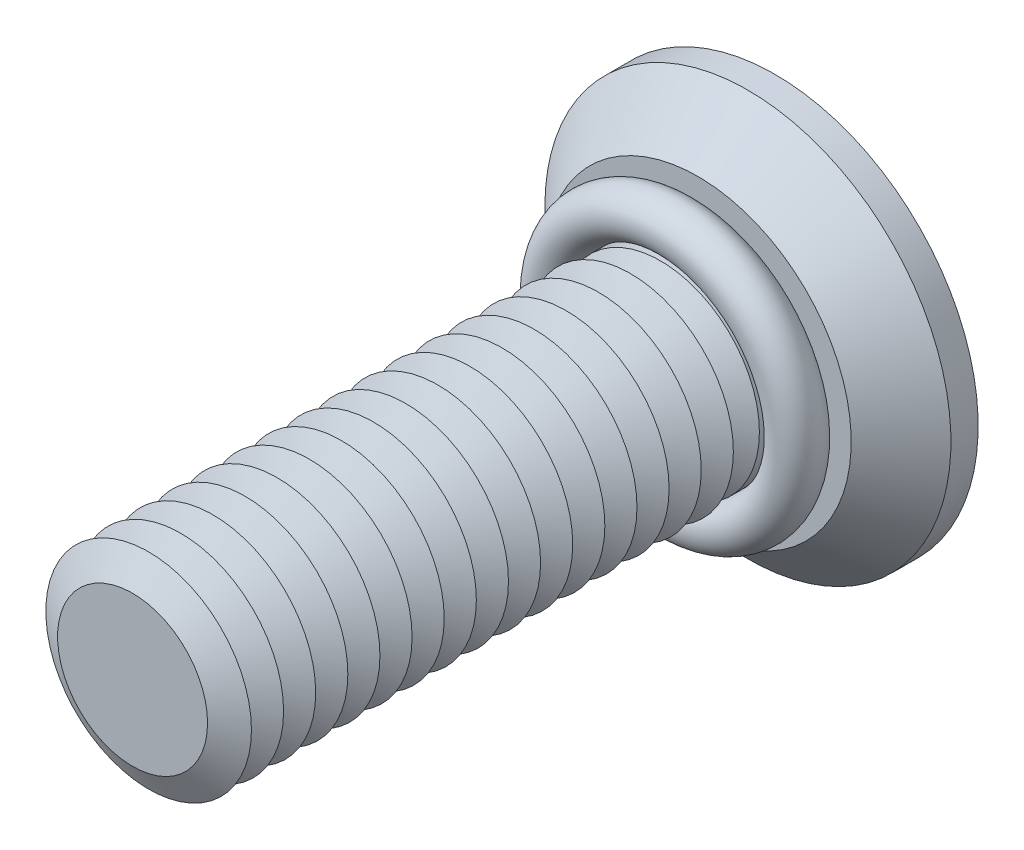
ISO-10303-21;
HEADER;
FILE_DESCRIPTION(('STEP AP214'),'2;1');
FILE_NAME('part.step','',(''),(''),'','','');
FILE_SCHEMA(('AUTOMOTIVE_DESIGN { 1 0 10303 214 1 1 1 1 }'));
ENDSEC;
DATA;
#1=APPLICATION_CONTEXT('core data for automotive mechanical design processes');
#2=APPLICATION_PROTOCOL_DEFINITION('international standard','automotive_design',2000,#1);
#3=PRODUCT_CONTEXT('',#1,'mechanical');
#4=PRODUCT('Part','Part','',(#3));
#5=PRODUCT_RELATED_PRODUCT_CATEGORY('part','',(#4));
#6=PRODUCT_DEFINITION_FORMATION('','',#4);
#7=PRODUCT_DEFINITION_CONTEXT('part definition',#1,'design');
#8=PRODUCT_DEFINITION('design','',#6,#7);
#9=PRODUCT_DEFINITION_SHAPE('','',#8);
#10=(LENGTH_UNIT() NAMED_UNIT(*) SI_UNIT(.MILLI.,.METRE.));
#11=(NAMED_UNIT(*) PLANE_ANGLE_UNIT() SI_UNIT($,.RADIAN.));
#12=(NAMED_UNIT(*) SI_UNIT($,.STERADIAN.) SOLID_ANGLE_UNIT());
#13=UNCERTAINTY_MEASURE_WITH_UNIT(LENGTH_MEASURE(1.E-05),#10,'distance_accuracy_value','');
#14=(GEOMETRIC_REPRESENTATION_CONTEXT(3) GLOBAL_UNCERTAINTY_ASSIGNED_CONTEXT((#13)) GLOBAL_UNIT_ASSIGNED_CONTEXT((#10,
#11,#12)) REPRESENTATION_CONTEXT('',''));
#15=CARTESIAN_POINT('',(0.,0.,0.));
#16=DIRECTION('',(0.,0.,1.));
#17=DIRECTION('',(1.,0.,0.));
#18=AXIS2_PLACEMENT_3D('',#15,#16,#17);
#19=CARTESIAN_POINT('',(0.,0.,3.9));
#20=DIRECTION('',(0.,0.,1.));
#21=DIRECTION('',(1.,0.,0.));
#22=AXIS2_PLACEMENT_3D('',#19,#20,#21);
#23=TOROIDAL_SURFACE('',#22,4.75,0.9);
#24=CARTESIAN_POINT('',(0.,4.75,3.9));
#25=DIRECTION('',(1.,0.,0.));
#26=DIRECTION('',(0.,0.,-1.));
#27=AXIS2_PLACEMENT_3D('',#24,#25,#26);
#28=CIRCLE('',#27,0.9);
#29=CARTESIAN_POINT('',(0.,5.65,3.9));
#30=VERTEX_POINT('',#29);
#31=EDGE_CURVE('P0_E10',#30,#30,#28,.T.);
#32=CARTESIAN_POINT('',(0.,0.,3.9));
#33=DIRECTION('',(0.,0.,1.));
#34=DIRECTION('',(1.,0.,0.));
#35=AXIS2_PLACEMENT_3D('',#32,#33,#34);
#36=CIRCLE('',#35,5.65);
#37=EDGE_CURVE('',#30,#30,#36,.T.);
#38=ORIENTED_EDGE('',*,*,#31,.F.);
#39=ORIENTED_EDGE('',*,*,#31,.T.);
#40=ORIENTED_EDGE('',*,*,#37,.T.);
#41=ORIENTED_EDGE('',*,*,#37,.F.);
#42=EDGE_LOOP('',(#38,#40,#39,#41));
#43=FACE_BOUND('',#42,.T.);
#44=ADVANCED_FACE('P0_F14',(#43),#23,.T.);
#45=CLOSED_SHELL('',(#44));
#46=MANIFOLD_SOLID_BREP('P0_B1',#45);
#47=CARTESIAN_POINT('',(0.,0.,18.75));
#48=DIRECTION('',(0.,0.,-1.));
#49=DIRECTION('',(-1.,0.,0.));
#50=AXIS2_PLACEMENT_3D('',#47,#48,#49);
#51=CONICAL_SURFACE('',#50,2.91746824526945,1.0471975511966);
#52=CARTESIAN_POINT('',(0.,0.,18.125));
#53=DIRECTION('',(0.,0.,1.));
#54=DIRECTION('',(1.,0.,0.));
#55=AXIS2_PLACEMENT_3D('',#52,#53,#54);
#56=CIRCLE('',#55,4.);
#57=CARTESIAN_POINT('',(4.,0.,18.125));
#58=VERTEX_POINT('',#57);
#59=EDGE_CURVE('P1_E324',#58,#58,#56,.T.);
#60=ORIENTED_EDGE('',*,*,#59,.T.);
#61=EDGE_LOOP('',(#60));
#62=FACE_BOUND('',#61,.T.);
#63=CARTESIAN_POINT('',(0.,0.,18.75));
#64=DIRECTION('',(0.,0.,1.));
#65=DIRECTION('',(1.,0.,0.));
#66=AXIS2_PLACEMENT_3D('',#63,#64,#65);
#67=CIRCLE('',#66,2.91746824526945);
#68=CARTESIAN_POINT('',(2.91746824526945,0.,18.75));
#69=VERTEX_POINT('',#68);
#70=EDGE_CURVE('P1_E321',#69,#69,#67,.T.);
#71=ORIENTED_EDGE('',*,*,#70,.F.);
#72=EDGE_LOOP('',(#71));
#73=FACE_BOUND('',#72,.T.);
#74=ADVANCED_FACE('P1_F15',(#62,#73),#51,.T.);
#75=CARTESIAN_POINT('',(0.,0.,19.375));
#76=DIRECTION('',(0.,0.,1.));
#77=DIRECTION('',(1.,0.,0.));
#78=AXIS2_PLACEMENT_3D('',#75,#76,#77);
#79=CONICAL_SURFACE('',#78,4.,1.0471975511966);
#80=ORIENTED_EDGE('',*,*,#70,.T.);
#81=EDGE_LOOP('',(#80));
#82=FACE_BOUND('',#81,.T.);
#83=CARTESIAN_POINT('',(0.,0.,19.375));
#84=DIRECTION('',(0.,0.,1.));
#85=DIRECTION('',(1.,0.,0.));
#86=AXIS2_PLACEMENT_3D('',#83,#84,#85);
#87=CIRCLE('',#86,4.);
#88=CARTESIAN_POINT('',(4.,0.,19.375));
#89=VERTEX_POINT('',#88);
#90=EDGE_CURVE('P1_E318',#89,#89,#87,.T.);
#91=ORIENTED_EDGE('',*,*,#90,.F.);
#92=EDGE_LOOP('',(#91));
#93=FACE_BOUND('',#92,.T.);
#94=ADVANCED_FACE('P1_F245',(#82,#93),#79,.T.);
#95=CARTESIAN_POINT('',(0.,0.,25.));
#96=DIRECTION('',(0.,0.,1.));
#97=DIRECTION('',(1.,0.,0.));
#98=AXIS2_PLACEMENT_3D('',#95,#96,#97);
#99=PLANE('',#98);
#100=CARTESIAN_POINT('',(0.,0.,25.));
#101=DIRECTION('',(0.,0.,1.));
#102=DIRECTION('',(1.,0.,0.));
#103=AXIS2_PLACEMENT_3D('',#100,#101,#102);
#104=CIRCLE('',#103,2.91746824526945);
#105=CARTESIAN_POINT('',(2.91746824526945,0.,25.));
#106=VERTEX_POINT('',#105);
#107=EDGE_CURVE('P1_E131',#106,#106,#104,.T.);
#108=ORIENTED_EDGE('',*,*,#107,.T.);
#109=EDGE_LOOP('',(#108));
#110=FACE_BOUND('',#109,.T.);
#111=ADVANCED_FACE('P1_F251',(#110),#99,.T.);
#112=CARTESIAN_POINT('',(0.,0.,25.));
#113=DIRECTION('',(0.,0.,-1.));
#114=DIRECTION('',(-1.,0.,0.));
#115=AXIS2_PLACEMENT_3D('',#112,#113,#114);
#116=CONICAL_SURFACE('',#115,2.91746824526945,1.0471975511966);
#117=CARTESIAN_POINT('',(0.,0.,24.375));
#118=DIRECTION('',(0.,0.,1.));
#119=DIRECTION('',(1.,0.,0.));
#120=AXIS2_PLACEMENT_3D('',#117,#118,#119);
#121=CIRCLE('',#120,4.);
#122=CARTESIAN_POINT('',(4.,0.,24.375));
#123=VERTEX_POINT('',#122);
#124=EDGE_CURVE('P1_E133',#123,#123,#121,.T.);
#125=ORIENTED_EDGE('',*,*,#124,.T.);
#126=EDGE_LOOP('',(#125));
#127=FACE_BOUND('',#126,.T.);
#128=ORIENTED_EDGE('',*,*,#107,.F.);
#129=EDGE_LOOP('',(#128));
#130=FACE_BOUND('',#129,.T.);
#131=ADVANCED_FACE('P1_F196',(#127,#130),#116,.T.);
#132=CARTESIAN_POINT('',(0.,0.,24.375));
#133=DIRECTION('',(0.,0.,1.));
#134=DIRECTION('',(1.,0.,0.));
#135=AXIS2_PLACEMENT_3D('',#132,#133,#134);
#136=CONICAL_SURFACE('',#135,4.,1.0471975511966);
#137=CARTESIAN_POINT('',(0.,0.,23.75));
#138=DIRECTION('',(0.,0.,1.));
#139=DIRECTION('',(1.,0.,0.));
#140=AXIS2_PLACEMENT_3D('',#137,#138,#139);
#141=CIRCLE('',#140,2.91746824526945);
#142=CARTESIAN_POINT('',(2.91746824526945,0.,23.75));
#143=VERTEX_POINT('',#142);
#144=EDGE_CURVE('P1_E297',#143,#143,#141,.T.);
#145=ORIENTED_EDGE('',*,*,#144,.T.);
#146=EDGE_LOOP('',(#145));
#147=FACE_BOUND('',#146,.T.);
#148=ORIENTED_EDGE('',*,*,#124,.F.);
#149=EDGE_LOOP('',(#148));
#150=FACE_BOUND('',#149,.T.);
#151=ADVANCED_FACE('P1_F284',(#147,#150),#136,.T.);
#152=CARTESIAN_POINT('',(0.,0.,23.75));
#153=DIRECTION('',(0.,0.,-1.));
#154=DIRECTION('',(-1.,0.,0.));
#155=AXIS2_PLACEMENT_3D('',#152,#153,#154);
#156=CONICAL_SURFACE('',#155,2.91746824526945,1.0471975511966);
#157=CARTESIAN_POINT('',(0.,0.,23.125));
#158=DIRECTION('',(0.,0.,1.));
#159=DIRECTION('',(1.,0.,0.));
#160=AXIS2_PLACEMENT_3D('',#157,#158,#159);
#161=CIRCLE('',#160,4.);
#162=CARTESIAN_POINT('',(4.,0.,23.125));
#163=VERTEX_POINT('',#162);
#164=EDGE_CURVE('P1_E294',#163,#163,#161,.T.);
#165=ORIENTED_EDGE('',*,*,#164,.T.);
#166=EDGE_LOOP('',(#165));
#167=FACE_BOUND('',#166,.T.);
#168=ORIENTED_EDGE('',*,*,#144,.F.);
#169=EDGE_LOOP('',(#168));
#170=FACE_BOUND('',#169,.T.);
#171=ADVANCED_FACE('P1_F279',(#167,#170),#156,.T.);
#172=CARTESIAN_POINT('',(0.,0.,23.125));
#173=DIRECTION('',(0.,0.,1.));
#174=DIRECTION('',(1.,0.,0.));
#175=AXIS2_PLACEMENT_3D('',#172,#173,#174);
#176=CONICAL_SURFACE('',#175,4.,1.0471975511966);
#177=CARTESIAN_POINT('',(0.,0.,22.5));
#178=DIRECTION('',(0.,0.,1.));
#179=DIRECTION('',(1.,0.,0.));
#180=AXIS2_PLACEMENT_3D('',#177,#178,#179);
#181=CIRCLE('',#180,2.91746824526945);
#182=CARTESIAN_POINT('',(2.91746824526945,0.,22.5));
#183=VERTEX_POINT('',#182);
#184=EDGE_CURVE('P1_E301',#183,#183,#181,.T.);
#185=ORIENTED_EDGE('',*,*,#184,.T.);
#186=EDGE_LOOP('',(#185));
#187=FACE_BOUND('',#186,.T.);
#188=ORIENTED_EDGE('',*,*,#164,.F.);
#189=EDGE_LOOP('',(#188));
#190=FACE_BOUND('',#189,.T.);
#191=ADVANCED_FACE('P1_F276',(#187,#190),#176,.T.);
#192=CARTESIAN_POINT('',(0.,0.,22.5));
#193=DIRECTION('',(0.,0.,-1.));
#194=DIRECTION('',(-1.,0.,0.));
#195=AXIS2_PLACEMENT_3D('',#192,#193,#194);
#196=CONICAL_SURFACE('',#195,2.91746824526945,1.0471975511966);
#197=CARTESIAN_POINT('',(0.,0.,21.875));
#198=DIRECTION('',(0.,0.,1.));
#199=DIRECTION('',(1.,0.,0.));
#200=AXIS2_PLACEMENT_3D('',#197,#198,#199);
#201=CIRCLE('',#200,4.);
#202=CARTESIAN_POINT('',(4.,0.,21.875));
#203=VERTEX_POINT('',#202);
#204=EDGE_CURVE('P1_E306',#203,#203,#201,.T.);
#205=ORIENTED_EDGE('',*,*,#204,.T.);
#206=EDGE_LOOP('',(#205));
#207=FACE_BOUND('',#206,.T.);
#208=ORIENTED_EDGE('',*,*,#184,.F.);
#209=EDGE_LOOP('',(#208));
#210=FACE_BOUND('',#209,.T.);
#211=ADVANCED_FACE('P1_F271',(#207,#210),#196,.T.);
#212=CARTESIAN_POINT('',(0.,0.,21.875));
#213=DIRECTION('',(0.,0.,1.));
#214=DIRECTION('',(1.,0.,0.));
#215=AXIS2_PLACEMENT_3D('',#212,#213,#214);
#216=CONICAL_SURFACE('',#215,4.,1.0471975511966);
#217=CARTESIAN_POINT('',(0.,0.,21.25));
#218=DIRECTION('',(0.,0.,1.));
#219=DIRECTION('',(1.,0.,0.));
#220=AXIS2_PLACEMENT_3D('',#217,#218,#219);
#221=CIRCLE('',#220,2.91746824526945);
#222=CARTESIAN_POINT('',(2.91746824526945,0.,21.25));
#223=VERTEX_POINT('',#222);
#224=EDGE_CURVE('P1_E309',#223,#223,#221,.T.);
#225=ORIENTED_EDGE('',*,*,#224,.T.);
#226=EDGE_LOOP('',(#225));
#227=FACE_BOUND('',#226,.T.);
#228=ORIENTED_EDGE('',*,*,#204,.F.);
#229=EDGE_LOOP('',(#228));
#230=FACE_BOUND('',#229,.T.);
#231=ADVANCED_FACE('P1_F268',(#227,#230),#216,.T.);
#232=CARTESIAN_POINT('',(0.,0.,21.25));
#233=DIRECTION('',(0.,0.,-1.));
#234=DIRECTION('',(-1.,0.,0.));
#235=AXIS2_PLACEMENT_3D('',#232,#233,#234);
#236=CONICAL_SURFACE('',#235,2.91746824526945,1.0471975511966);
#237=CARTESIAN_POINT('',(0.,0.,20.625));
#238=DIRECTION('',(0.,0.,1.));
#239=DIRECTION('',(1.,0.,0.));
#240=AXIS2_PLACEMENT_3D('',#237,#238,#239);
#241=CIRCLE('',#240,4.);
#242=CARTESIAN_POINT('',(4.,0.,20.625));
#243=VERTEX_POINT('',#242);
#244=EDGE_CURVE('P1_E312',#243,#243,#241,.T.);
#245=ORIENTED_EDGE('',*,*,#244,.T.);
#246=EDGE_LOOP('',(#245));
#247=FACE_BOUND('',#246,.T.);
#248=ORIENTED_EDGE('',*,*,#224,.F.);
#249=EDGE_LOOP('',(#248));
#250=FACE_BOUND('',#249,.T.);
#251=ADVANCED_FACE('P1_F262',(#247,#250),#236,.T.);
#252=CARTESIAN_POINT('',(0.,0.,20.625));
#253=DIRECTION('',(0.,0.,1.));
#254=DIRECTION('',(1.,0.,0.));
#255=AXIS2_PLACEMENT_3D('',#252,#253,#254);
#256=CONICAL_SURFACE('',#255,4.,1.0471975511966);
#257=CARTESIAN_POINT('',(0.,0.,20.));
#258=DIRECTION('',(0.,0.,1.));
#259=DIRECTION('',(1.,0.,0.));
#260=AXIS2_PLACEMENT_3D('',#257,#258,#259);
#261=CIRCLE('',#260,2.91746824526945);
#262=CARTESIAN_POINT('',(2.91746824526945,0.,20.));
#263=VERTEX_POINT('',#262);
#264=EDGE_CURVE('P1_E315',#263,#263,#261,.T.);
#265=ORIENTED_EDGE('',*,*,#264,.T.);
#266=EDGE_LOOP('',(#265));
#267=FACE_BOUND('',#266,.T.);
#268=ORIENTED_EDGE('',*,*,#244,.F.);
#269=EDGE_LOOP('',(#268));
#270=FACE_BOUND('',#269,.T.);
#271=ADVANCED_FACE('P1_F258',(#267,#270),#256,.T.);
#272=CARTESIAN_POINT('',(0.,0.,20.));
#273=DIRECTION('',(0.,0.,-1.));
#274=DIRECTION('',(-1.,0.,0.));
#275=AXIS2_PLACEMENT_3D('',#272,#273,#274);
#276=CONICAL_SURFACE('',#275,2.91746824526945,1.0471975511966);
#277=ORIENTED_EDGE('',*,*,#90,.T.);
#278=EDGE_LOOP('',(#277));
#279=FACE_BOUND('',#278,.T.);
#280=ORIENTED_EDGE('',*,*,#264,.F.);
#281=EDGE_LOOP('',(#280));
#282=FACE_BOUND('',#281,.T.);
#283=ADVANCED_FACE('P1_F261',(#279,#282),#276,.T.);
#284=CARTESIAN_POINT('',(0.,0.,17.5));
#285=DIRECTION('',(0.,0.,-1.));
#286=DIRECTION('',(-1.,0.,0.));
#287=AXIS2_PLACEMENT_3D('',#284,#285,#286);
#288=CONICAL_SURFACE('',#287,2.91746824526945,1.0471975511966);
#289=CARTESIAN_POINT('',(0.,0.,16.875));
#290=DIRECTION('',(0.,0.,1.));
#291=DIRECTION('',(1.,0.,0.));
#292=AXIS2_PLACEMENT_3D('',#289,#290,#291);
#293=CIRCLE('',#292,4.);
#294=CARTESIAN_POINT('',(4.,0.,16.875));
#295=VERTEX_POINT('',#294);
#296=EDGE_CURVE('P1_E329',#295,#295,#293,.T.);
#297=ORIENTED_EDGE('',*,*,#296,.T.);
#298=EDGE_LOOP('',(#297));
#299=FACE_BOUND('',#298,.T.);
#300=CARTESIAN_POINT('',(0.,0.,17.5));
#301=DIRECTION('',(0.,0.,1.));
#302=DIRECTION('',(1.,0.,0.));
#303=AXIS2_PLACEMENT_3D('',#300,#301,#302);
#304=CIRCLE('',#303,2.91746824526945);
#305=CARTESIAN_POINT('',(2.91746824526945,0.,17.5));
#306=VERTEX_POINT('',#305);
#307=EDGE_CURVE('P1_E326',#306,#306,#304,.T.);
#308=ORIENTED_EDGE('',*,*,#307,.F.);
#309=EDGE_LOOP('',(#308));
#310=FACE_BOUND('',#309,.T.);
#311=ADVANCED_FACE('P1_F266',(#299,#310),#288,.T.);
#312=CARTESIAN_POINT('',(0.,0.,18.125));
#313=DIRECTION('',(0.,0.,1.));
#314=DIRECTION('',(1.,0.,0.));
#315=AXIS2_PLACEMENT_3D('',#312,#313,#314);
#316=CONICAL_SURFACE('',#315,4.,1.0471975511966);
#317=ORIENTED_EDGE('',*,*,#307,.T.);
#318=EDGE_LOOP('',(#317));
#319=FACE_BOUND('',#318,.T.);
#320=ORIENTED_EDGE('',*,*,#59,.F.);
#321=EDGE_LOOP('',(#320));
#322=FACE_BOUND('',#321,.T.);
#323=ADVANCED_FACE('P1_F491',(#319,#322),#316,.T.);
#324=CARTESIAN_POINT('',(0.,0.,16.25));
#325=DIRECTION('',(0.,0.,-1.));
#326=DIRECTION('',(-1.,0.,0.));
#327=AXIS2_PLACEMENT_3D('',#324,#325,#326);
#328=CONICAL_SURFACE('',#327,2.91746824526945,1.0471975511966);
#329=CARTESIAN_POINT('',(0.,0.,15.625));
#330=DIRECTION('',(0.,0.,1.));
#331=DIRECTION('',(1.,0.,0.));
#332=AXIS2_PLACEMENT_3D('',#329,#330,#331);
#333=CIRCLE('',#332,4.);
#334=CARTESIAN_POINT('',(4.,0.,15.625));
#335=VERTEX_POINT('',#334);
#336=EDGE_CURVE('P1_E335',#335,#335,#333,.T.);
#337=ORIENTED_EDGE('',*,*,#336,.T.);
#338=EDGE_LOOP('',(#337));
#339=FACE_BOUND('',#338,.T.);
#340=CARTESIAN_POINT('',(0.,0.,16.25));
#341=DIRECTION('',(0.,0.,1.));
#342=DIRECTION('',(1.,0.,0.));
#343=AXIS2_PLACEMENT_3D('',#340,#341,#342);
#344=CIRCLE('',#343,2.91746824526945);
#345=CARTESIAN_POINT('',(2.91746824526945,0.,16.25));
#346=VERTEX_POINT('',#345);
#347=EDGE_CURVE('P1_E332',#346,#346,#344,.T.);
#348=ORIENTED_EDGE('',*,*,#347,.F.);
#349=EDGE_LOOP('',(#348));
#350=FACE_BOUND('',#349,.T.);
#351=ADVANCED_FACE('P1_F501',(#339,#350),#328,.T.);
#352=CARTESIAN_POINT('',(0.,0.,16.875));
#353=DIRECTION('',(0.,0.,1.));
#354=DIRECTION('',(1.,0.,0.));
#355=AXIS2_PLACEMENT_3D('',#352,#353,#354);
#356=CONICAL_SURFACE('',#355,4.,1.0471975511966);
#357=ORIENTED_EDGE('',*,*,#347,.T.);
#358=EDGE_LOOP('',(#357));
#359=FACE_BOUND('',#358,.T.);
#360=ORIENTED_EDGE('',*,*,#296,.F.);
#361=EDGE_LOOP('',(#360));
#362=FACE_BOUND('',#361,.T.);
#363=ADVANCED_FACE('P1_F511',(#359,#362),#356,.T.);
#364=CARTESIAN_POINT('',(0.,0.,15.));
#365=DIRECTION('',(0.,0.,-1.));
#366=DIRECTION('',(-1.,0.,0.));
#367=AXIS2_PLACEMENT_3D('',#364,#365,#366);
#368=CONICAL_SURFACE('',#367,2.91746824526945,1.0471975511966);
#369=CARTESIAN_POINT('',(0.,0.,14.375));
#370=DIRECTION('',(0.,0.,1.));
#371=DIRECTION('',(1.,0.,0.));
#372=AXIS2_PLACEMENT_3D('',#369,#370,#371);
#373=CIRCLE('',#372,4.);
#374=CARTESIAN_POINT('',(4.,0.,14.375));
#375=VERTEX_POINT('',#374);
#376=EDGE_CURVE('P1_E341',#375,#375,#373,.T.);
#377=ORIENTED_EDGE('',*,*,#376,.T.);
#378=EDGE_LOOP('',(#377));
#379=FACE_BOUND('',#378,.T.);
#380=CARTESIAN_POINT('',(0.,0.,15.));
#381=DIRECTION('',(0.,0.,1.));
#382=DIRECTION('',(1.,0.,0.));
#383=AXIS2_PLACEMENT_3D('',#380,#381,#382);
#384=CIRCLE('',#383,2.91746824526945);
#385=CARTESIAN_POINT('',(2.91746824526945,0.,15.));
#386=VERTEX_POINT('',#385);
#387=EDGE_CURVE('P1_E338',#386,#386,#384,.T.);
#388=ORIENTED_EDGE('',*,*,#387,.F.);
#389=EDGE_LOOP('',(#388));
#390=FACE_BOUND('',#389,.T.);
#391=ADVANCED_FACE('P1_F521',(#379,#390),#368,.T.);
#392=CARTESIAN_POINT('',(0.,0.,15.625));
#393=DIRECTION('',(0.,0.,1.));
#394=DIRECTION('',(1.,0.,0.));
#395=AXIS2_PLACEMENT_3D('',#392,#393,#394);
#396=CONICAL_SURFACE('',#395,4.,1.0471975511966);
#397=ORIENTED_EDGE('',*,*,#387,.T.);
#398=EDGE_LOOP('',(#397));
#399=FACE_BOUND('',#398,.T.);
#400=ORIENTED_EDGE('',*,*,#336,.F.);
#401=EDGE_LOOP('',(#400));
#402=FACE_BOUND('',#401,.T.);
#403=ADVANCED_FACE('P1_F531',(#399,#402),#396,.T.);
#404=CARTESIAN_POINT('',(0.,0.,13.75));
#405=DIRECTION('',(0.,0.,-1.));
#406=DIRECTION('',(-1.,0.,0.));
#407=AXIS2_PLACEMENT_3D('',#404,#405,#406);
#408=CONICAL_SURFACE('',#407,2.91746824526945,1.0471975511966);
#409=CARTESIAN_POINT('',(0.,0.,13.125));
#410=DIRECTION('',(0.,0.,1.));
#411=DIRECTION('',(1.,0.,0.));
#412=AXIS2_PLACEMENT_3D('',#409,#410,#411);
#413=CIRCLE('',#412,4.);
#414=CARTESIAN_POINT('',(4.,0.,13.125));
#415=VERTEX_POINT('',#414);
#416=EDGE_CURVE('P1_E347',#415,#415,#413,.T.);
#417=ORIENTED_EDGE('',*,*,#416,.T.);
#418=EDGE_LOOP('',(#417));
#419=FACE_BOUND('',#418,.T.);
#420=CARTESIAN_POINT('',(0.,0.,13.75));
#421=DIRECTION('',(0.,0.,1.));
#422=DIRECTION('',(1.,0.,0.));
#423=AXIS2_PLACEMENT_3D('',#420,#421,#422);
#424=CIRCLE('',#423,2.91746824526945);
#425=CARTESIAN_POINT('',(2.91746824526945,0.,13.75));
#426=VERTEX_POINT('',#425);
#427=EDGE_CURVE('P1_E344',#426,#426,#424,.T.);
#428=ORIENTED_EDGE('',*,*,#427,.F.);
#429=EDGE_LOOP('',(#428));
#430=FACE_BOUND('',#429,.T.);
#431=ADVANCED_FACE('P1_F541',(#419,#430),#408,.T.);
#432=CARTESIAN_POINT('',(0.,0.,14.375));
#433=DIRECTION('',(0.,0.,1.));
#434=DIRECTION('',(1.,0.,0.));
#435=AXIS2_PLACEMENT_3D('',#432,#433,#434);
#436=CONICAL_SURFACE('',#435,4.,1.0471975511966);
#437=ORIENTED_EDGE('',*,*,#427,.T.);
#438=EDGE_LOOP('',(#437));
#439=FACE_BOUND('',#438,.T.);
#440=ORIENTED_EDGE('',*,*,#376,.F.);
#441=EDGE_LOOP('',(#440));
#442=FACE_BOUND('',#441,.T.);
#443=ADVANCED_FACE('P1_F551',(#439,#442),#436,.T.);
#444=CARTESIAN_POINT('',(0.,0.,12.5));
#445=DIRECTION('',(0.,0.,-1.));
#446=DIRECTION('',(-1.,0.,0.));
#447=AXIS2_PLACEMENT_3D('',#444,#445,#446);
#448=CONICAL_SURFACE('',#447,2.91746824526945,1.0471975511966);
#449=CARTESIAN_POINT('',(0.,0.,11.875));
#450=DIRECTION('',(0.,0.,1.));
#451=DIRECTION('',(1.,0.,0.));
#452=AXIS2_PLACEMENT_3D('',#449,#450,#451);
#453=CIRCLE('',#452,4.);
#454=CARTESIAN_POINT('',(4.,0.,11.875));
#455=VERTEX_POINT('',#454);
#456=EDGE_CURVE('P1_E353',#455,#455,#453,.T.);
#457=ORIENTED_EDGE('',*,*,#456,.T.);
#458=EDGE_LOOP('',(#457));
#459=FACE_BOUND('',#458,.T.);
#460=CARTESIAN_POINT('',(0.,0.,12.5));
#461=DIRECTION('',(0.,0.,1.));
#462=DIRECTION('',(1.,0.,0.));
#463=AXIS2_PLACEMENT_3D('',#460,#461,#462);
#464=CIRCLE('',#463,2.91746824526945);
#465=CARTESIAN_POINT('',(2.91746824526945,0.,12.5));
#466=VERTEX_POINT('',#465);
#467=EDGE_CURVE('P1_E350',#466,#466,#464,.T.);
#468=ORIENTED_EDGE('',*,*,#467,.F.);
#469=EDGE_LOOP('',(#468));
#470=FACE_BOUND('',#469,.T.);
#471=ADVANCED_FACE('P1_F561',(#459,#470),#448,.T.);
#472=CARTESIAN_POINT('',(0.,0.,13.125));
#473=DIRECTION('',(0.,0.,1.));
#474=DIRECTION('',(1.,0.,0.));
#475=AXIS2_PLACEMENT_3D('',#472,#473,#474);
#476=CONICAL_SURFACE('',#475,4.,1.0471975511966);
#477=ORIENTED_EDGE('',*,*,#467,.T.);
#478=EDGE_LOOP('',(#477));
#479=FACE_BOUND('',#478,.T.);
#480=ORIENTED_EDGE('',*,*,#416,.F.);
#481=EDGE_LOOP('',(#480));
#482=FACE_BOUND('',#481,.T.);
#483=ADVANCED_FACE('P1_F571',(#479,#482),#476,.T.);
#484=CARTESIAN_POINT('',(0.,0.,11.25));
#485=DIRECTION('',(0.,0.,-1.));
#486=DIRECTION('',(-1.,0.,0.));
#487=AXIS2_PLACEMENT_3D('',#484,#485,#486);
#488=CONICAL_SURFACE('',#487,2.91746824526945,1.0471975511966);
#489=CARTESIAN_POINT('',(0.,0.,10.625));
#490=DIRECTION('',(0.,0.,1.));
#491=DIRECTION('',(1.,0.,0.));
#492=AXIS2_PLACEMENT_3D('',#489,#490,#491);
#493=CIRCLE('',#492,4.);
#494=CARTESIAN_POINT('',(4.,0.,10.625));
#495=VERTEX_POINT('',#494);
#496=EDGE_CURVE('P1_E359',#495,#495,#493,.T.);
#497=ORIENTED_EDGE('',*,*,#496,.T.);
#498=EDGE_LOOP('',(#497));
#499=FACE_BOUND('',#498,.T.);
#500=CARTESIAN_POINT('',(0.,0.,11.25));
#501=DIRECTION('',(0.,0.,1.));
#502=DIRECTION('',(1.,0.,0.));
#503=AXIS2_PLACEMENT_3D('',#500,#501,#502);
#504=CIRCLE('',#503,2.91746824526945);
#505=CARTESIAN_POINT('',(2.91746824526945,0.,11.25));
#506=VERTEX_POINT('',#505);
#507=EDGE_CURVE('P1_E356',#506,#506,#504,.T.);
#508=ORIENTED_EDGE('',*,*,#507,.F.);
#509=EDGE_LOOP('',(#508));
#510=FACE_BOUND('',#509,.T.);
#511=ADVANCED_FACE('P1_F581',(#499,#510),#488,.T.);
#512=CARTESIAN_POINT('',(0.,0.,11.875));
#513=DIRECTION('',(0.,0.,1.));
#514=DIRECTION('',(1.,0.,0.));
#515=AXIS2_PLACEMENT_3D('',#512,#513,#514);
#516=CONICAL_SURFACE('',#515,4.,1.0471975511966);
#517=ORIENTED_EDGE('',*,*,#507,.T.);
#518=EDGE_LOOP('',(#517));
#519=FACE_BOUND('',#518,.T.);
#520=ORIENTED_EDGE('',*,*,#456,.F.);
#521=EDGE_LOOP('',(#520));
#522=FACE_BOUND('',#521,.T.);
#523=ADVANCED_FACE('P1_F591',(#519,#522),#516,.T.);
#524=CARTESIAN_POINT('',(0.,0.,10.));
#525=DIRECTION('',(0.,0.,-1.));
#526=DIRECTION('',(-1.,0.,0.));
#527=AXIS2_PLACEMENT_3D('',#524,#525,#526);
#528=CONICAL_SURFACE('',#527,2.91746824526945,1.0471975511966);
#529=CARTESIAN_POINT('',(0.,0.,9.375));
#530=DIRECTION('',(0.,0.,1.));
#531=DIRECTION('',(1.,0.,0.));
#532=AXIS2_PLACEMENT_3D('',#529,#530,#531);
#533=CIRCLE('',#532,4.);
#534=CARTESIAN_POINT('',(4.,0.,9.375));
#535=VERTEX_POINT('',#534);
#536=EDGE_CURVE('P1_E365',#535,#535,#533,.T.);
#537=ORIENTED_EDGE('',*,*,#536,.T.);
#538=EDGE_LOOP('',(#537));
#539=FACE_BOUND('',#538,.T.);
#540=CARTESIAN_POINT('',(0.,0.,10.));
#541=DIRECTION('',(0.,0.,1.));
#542=DIRECTION('',(1.,0.,0.));
#543=AXIS2_PLACEMENT_3D('',#540,#541,#542);
#544=CIRCLE('',#543,2.91746824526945);
#545=CARTESIAN_POINT('',(2.91746824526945,0.,10.));
#546=VERTEX_POINT('',#545);
#547=EDGE_CURVE('P1_E362',#546,#546,#544,.T.);
#548=ORIENTED_EDGE('',*,*,#547,.F.);
#549=EDGE_LOOP('',(#548));
#550=FACE_BOUND('',#549,.T.);
#551=ADVANCED_FACE('P1_F601',(#539,#550),#528,.T.);
#552=CARTESIAN_POINT('',(0.,0.,10.625));
#553=DIRECTION('',(0.,0.,1.));
#554=DIRECTION('',(1.,0.,0.));
#555=AXIS2_PLACEMENT_3D('',#552,#553,#554);
#556=CONICAL_SURFACE('',#555,4.,1.0471975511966);
#557=ORIENTED_EDGE('',*,*,#547,.T.);
#558=EDGE_LOOP('',(#557));
#559=FACE_BOUND('',#558,.T.);
#560=ORIENTED_EDGE('',*,*,#496,.F.);
#561=EDGE_LOOP('',(#560));
#562=FACE_BOUND('',#561,.T.);
#563=ADVANCED_FACE('P1_F611',(#559,#562),#556,.T.);
#564=CARTESIAN_POINT('',(0.,0.,8.75));
#565=DIRECTION('',(0.,0.,-1.));
#566=DIRECTION('',(-1.,0.,0.));
#567=AXIS2_PLACEMENT_3D('',#564,#565,#566);
#568=CONICAL_SURFACE('',#567,2.91746824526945,1.0471975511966);
#569=CARTESIAN_POINT('',(0.,0.,8.125));
#570=DIRECTION('',(0.,0.,1.));
#571=DIRECTION('',(1.,0.,0.));
#572=AXIS2_PLACEMENT_3D('',#569,#570,#571);
#573=CIRCLE('',#572,4.);
#574=CARTESIAN_POINT('',(4.,0.,8.125));
#575=VERTEX_POINT('',#574);
#576=EDGE_CURVE('P1_E371',#575,#575,#573,.T.);
#577=ORIENTED_EDGE('',*,*,#576,.T.);
#578=EDGE_LOOP('',(#577));
#579=FACE_BOUND('',#578,.T.);
#580=CARTESIAN_POINT('',(0.,0.,8.75));
#581=DIRECTION('',(0.,0.,1.));
#582=DIRECTION('',(1.,0.,0.));
#583=AXIS2_PLACEMENT_3D('',#580,#581,#582);
#584=CIRCLE('',#583,2.91746824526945);
#585=CARTESIAN_POINT('',(2.91746824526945,0.,8.75));
#586=VERTEX_POINT('',#585);
#587=EDGE_CURVE('P1_E368',#586,#586,#584,.T.);
#588=ORIENTED_EDGE('',*,*,#587,.F.);
#589=EDGE_LOOP('',(#588));
#590=FACE_BOUND('',#589,.T.);
#591=ADVANCED_FACE('P1_F621',(#579,#590),#568,.T.);
#592=CARTESIAN_POINT('',(0.,0.,9.375));
#593=DIRECTION('',(0.,0.,1.));
#594=DIRECTION('',(1.,0.,0.));
#595=AXIS2_PLACEMENT_3D('',#592,#593,#594);
#596=CONICAL_SURFACE('',#595,4.,1.0471975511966);
#597=ORIENTED_EDGE('',*,*,#587,.T.);
#598=EDGE_LOOP('',(#597));
#599=FACE_BOUND('',#598,.T.);
#600=ORIENTED_EDGE('',*,*,#536,.F.);
#601=EDGE_LOOP('',(#600));
#602=FACE_BOUND('',#601,.T.);
#603=ADVANCED_FACE('P1_F631',(#599,#602),#596,.T.);
#604=CARTESIAN_POINT('',(0.,0.,7.5));
#605=DIRECTION('',(0.,0.,-1.));
#606=DIRECTION('',(-1.,0.,0.));
#607=AXIS2_PLACEMENT_3D('',#604,#605,#606);
#608=CONICAL_SURFACE('',#607,2.91746824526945,1.0471975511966);
#609=CARTESIAN_POINT('',(0.,0.,6.875));
#610=DIRECTION('',(0.,0.,1.));
#611=DIRECTION('',(1.,0.,0.));
#612=AXIS2_PLACEMENT_3D('',#609,#610,#611);
#613=CIRCLE('',#612,4.);
#614=CARTESIAN_POINT('',(4.,0.,6.875));
#615=VERTEX_POINT('',#614);
#616=EDGE_CURVE('P1_E377',#615,#615,#613,.T.);
#617=ORIENTED_EDGE('',*,*,#616,.T.);
#618=EDGE_LOOP('',(#617));
#619=FACE_BOUND('',#618,.T.);
#620=CARTESIAN_POINT('',(0.,0.,7.5));
#621=DIRECTION('',(0.,0.,1.));
#622=DIRECTION('',(1.,0.,0.));
#623=AXIS2_PLACEMENT_3D('',#620,#621,#622);
#624=CIRCLE('',#623,2.91746824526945);
#625=CARTESIAN_POINT('',(2.91746824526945,0.,7.5));
#626=VERTEX_POINT('',#625);
#627=EDGE_CURVE('P1_E374',#626,#626,#624,.T.);
#628=ORIENTED_EDGE('',*,*,#627,.F.);
#629=EDGE_LOOP('',(#628));
#630=FACE_BOUND('',#629,.T.);
#631=ADVANCED_FACE('P1_F641',(#619,#630),#608,.T.);
#632=CARTESIAN_POINT('',(0.,0.,8.125));
#633=DIRECTION('',(0.,0.,1.));
#634=DIRECTION('',(1.,0.,0.));
#635=AXIS2_PLACEMENT_3D('',#632,#633,#634);
#636=CONICAL_SURFACE('',#635,4.,1.0471975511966);
#637=ORIENTED_EDGE('',*,*,#627,.T.);
#638=EDGE_LOOP('',(#637));
#639=FACE_BOUND('',#638,.T.);
#640=ORIENTED_EDGE('',*,*,#576,.F.);
#641=EDGE_LOOP('',(#640));
#642=FACE_BOUND('',#641,.T.);
#643=ADVANCED_FACE('P1_F651',(#639,#642),#636,.T.);
#644=CARTESIAN_POINT('',(0.,0.,6.25));
#645=DIRECTION('',(0.,0.,-1.));
#646=DIRECTION('',(-1.,0.,0.));
#647=AXIS2_PLACEMENT_3D('',#644,#645,#646);
#648=CONICAL_SURFACE('',#647,2.91746824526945,1.0471975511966);
#649=CARTESIAN_POINT('',(0.,0.,5.625));
#650=DIRECTION('',(0.,0.,1.));
#651=DIRECTION('',(1.,0.,0.));
#652=AXIS2_PLACEMENT_3D('',#649,#650,#651);
#653=CIRCLE('',#652,4.);
#654=CARTESIAN_POINT('',(4.,0.,5.625));
#655=VERTEX_POINT('',#654);
#656=EDGE_CURVE('P1_E383',#655,#655,#653,.T.);
#657=ORIENTED_EDGE('',*,*,#656,.T.);
#658=EDGE_LOOP('',(#657));
#659=FACE_BOUND('',#658,.T.);
#660=CARTESIAN_POINT('',(0.,0.,6.25));
#661=DIRECTION('',(0.,0.,1.));
#662=DIRECTION('',(1.,0.,0.));
#663=AXIS2_PLACEMENT_3D('',#660,#661,#662);
#664=CIRCLE('',#663,2.91746824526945);
#665=CARTESIAN_POINT('',(2.91746824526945,0.,6.25));
#666=VERTEX_POINT('',#665);
#667=EDGE_CURVE('P1_E380',#666,#666,#664,.T.);
#668=ORIENTED_EDGE('',*,*,#667,.F.);
#669=EDGE_LOOP('',(#668));
#670=FACE_BOUND('',#669,.T.);
#671=ADVANCED_FACE('P1_F661',(#659,#670),#648,.T.);
#672=CARTESIAN_POINT('',(0.,0.,6.875));
#673=DIRECTION('',(0.,0.,1.));
#674=DIRECTION('',(1.,0.,0.));
#675=AXIS2_PLACEMENT_3D('',#672,#673,#674);
#676=CONICAL_SURFACE('',#675,4.,1.0471975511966);
#677=ORIENTED_EDGE('',*,*,#667,.T.);
#678=EDGE_LOOP('',(#677));
#679=FACE_BOUND('',#678,.T.);
#680=ORIENTED_EDGE('',*,*,#616,.F.);
#681=EDGE_LOOP('',(#680));
#682=FACE_BOUND('',#681,.T.);
#683=ADVANCED_FACE('P1_F396',(#679,#682),#676,.T.);
#684=CARTESIAN_POINT('',(0.,0.,5.));
#685=DIRECTION('',(0.,0.,-1.));
#686=DIRECTION('',(-1.,0.,0.));
#687=AXIS2_PLACEMENT_3D('',#684,#685,#686);
#688=CONICAL_SURFACE('',#687,2.91746824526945,1.0471975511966);
#689=CARTESIAN_POINT('',(0.,0.,5.));
#690=DIRECTION('',(0.,0.,1.));
#691=DIRECTION('',(1.,0.,0.));
#692=AXIS2_PLACEMENT_3D('',#689,#690,#691);
#693=CIRCLE('',#692,2.91746824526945);
#694=CARTESIAN_POINT('',(2.91746824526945,0.,5.));
#695=VERTEX_POINT('',#694);
#696=EDGE_CURVE('P1_E386',#695,#695,#693,.T.);
#697=ORIENTED_EDGE('',*,*,#696,.F.);
#698=EDGE_LOOP('',(#697));
#699=FACE_BOUND('',#698,.T.);
#700=CARTESIAN_POINT('',(0.,0.,4.46160254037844));
#701=DIRECTION('',(0.,0.,-1.));
#702=DIRECTION('',(-1.,0.,0.));
#703=AXIS2_PLACEMENT_3D('',#700,#701,#702);
#704=CIRCLE('',#703,3.85);
#705=CARTESIAN_POINT('',(-3.85,0.,4.46160254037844));
#706=VERTEX_POINT('',#705);
#707=EDGE_CURVE('P1_E19',#706,#706,#704,.F.);
#708=ORIENTED_EDGE('',*,*,#707,.T.);
#709=EDGE_LOOP('',(#708));
#710=FACE_BOUND('',#709,.T.);
#711=ADVANCED_FACE('P1_F393',(#699,#710),#688,.T.);
#712=CARTESIAN_POINT('',(0.,0.,5.625));
#713=DIRECTION('',(0.,0.,1.));
#714=DIRECTION('',(1.,0.,0.));
#715=AXIS2_PLACEMENT_3D('',#712,#713,#714);
#716=CONICAL_SURFACE('',#715,4.,1.0471975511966);
#717=ORIENTED_EDGE('',*,*,#696,.T.);
#718=EDGE_LOOP('',(#717));
#719=FACE_BOUND('',#718,.T.);
#720=ORIENTED_EDGE('',*,*,#656,.F.);
#721=EDGE_LOOP('',(#720));
#722=FACE_BOUND('',#721,.T.);
#723=ADVANCED_FACE('P1_F390',(#719,#722),#716,.T.);
#724=CARTESIAN_POINT('',(0.,0.,3.));
#725=DIRECTION('',(0.,0.,-1.));
#726=DIRECTION('',(-1.,0.,0.));
#727=AXIS2_PLACEMENT_3D('',#724,#725,#726);
#728=CONICAL_SURFACE('',#727,2.5,1.0471975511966);
#729=CARTESIAN_POINT('',(0.,0.,4.44337567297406));
#730=VERTEX_POINT('',#729);
#731=VERTEX_LOOP('',#730);
#732=FACE_BOUND('',#731,.T.);
#733=CARTESIAN_POINT('',(0.,0.,3.));
#734=DIRECTION('',(0.,0.,-1.));
#735=DIRECTION('',(-1.,0.,0.));
#736=AXIS2_PLACEMENT_3D('',#733,#734,#735);
#737=CIRCLE('',#736,2.5);
#738=CARTESIAN_POINT('',(-2.5,0.,3.));
#739=VERTEX_POINT('',#738);
#740=CARTESIAN_POINT('',(-1.25,2.1650635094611,3.));
#741=VERTEX_POINT('',#740);
#742=EDGE_CURVE('P1_E117',#739,#741,#737,.T.);
#743=ORIENTED_EDGE('',*,*,#742,.T.);
#744=CARTESIAN_POINT('',(0.,0.,3.));
#745=DIRECTION('',(0.,0.,-1.));
#746=DIRECTION('',(-1.,0.,0.));
#747=AXIS2_PLACEMENT_3D('',#744,#745,#746);
#748=CIRCLE('',#747,2.5);
#749=CARTESIAN_POINT('',(1.25,2.1650635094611,3.));
#750=VERTEX_POINT('',#749);
#751=EDGE_CURVE('P1_E24',#741,#750,#748,.T.);
#752=ORIENTED_EDGE('',*,*,#751,.T.);
#753=CARTESIAN_POINT('',(2.5,0.,3.));
#754=VERTEX_POINT('',#753);
#755=EDGE_CURVE('P1_E895',#750,#754,#748,.T.);
#756=ORIENTED_EDGE('',*,*,#755,.T.);
#757=CARTESIAN_POINT('',(1.25,-2.1650635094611,3.));
#758=VERTEX_POINT('',#757);
#759=EDGE_CURVE('P1_E888',#754,#758,#748,.T.);
#760=ORIENTED_EDGE('',*,*,#759,.T.);
#761=CARTESIAN_POINT('',(-1.25,-2.1650635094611,3.));
#762=VERTEX_POINT('',#761);
#763=EDGE_CURVE('P1_E182',#758,#762,#748,.T.);
#764=ORIENTED_EDGE('',*,*,#763,.T.);
#765=EDGE_CURVE('P1_E179',#762,#739,#748,.T.);
#766=ORIENTED_EDGE('',*,*,#765,.T.);
#767=EDGE_LOOP('',(#743,#752,#756,#760,#764,#766));
#768=FACE_BOUND('',#767,.T.);
#769=ADVANCED_FACE('P1_F198',(#732,#768),#728,.F.);
#770=CARTESIAN_POINT('',(0.,0.,3.));
#771=DIRECTION('',(0.,0.,-1.));
#772=DIRECTION('',(-1.,0.,0.));
#773=AXIS2_PLACEMENT_3D('',#770,#771,#772);
#774=PLANE('',#773);
#775=ORIENTED_EDGE('',*,*,#763,.F.);
#776=DIRECTION('',(-0.866025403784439,-0.5,0.));
#777=VECTOR('',#776,1.);
#778=CARTESIAN_POINT('',(2.5,-1.44337567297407,3.));
#779=LINE('',#778,#777);
#780=CARTESIAN_POINT('',(0.,-2.88675134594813,3.));
#781=VERTEX_POINT('',#780);
#782=EDGE_CURVE('P1_E904',#758,#781,#779,.T.);
#783=ORIENTED_EDGE('',*,*,#782,.T.);
#784=DIRECTION('',(-0.866025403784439,0.5,0.));
#785=VECTOR('',#784,1.);
#786=CARTESIAN_POINT('',(0.,-2.88675134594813,3.));
#787=LINE('',#786,#785);
#788=EDGE_CURVE('P1_E911',#781,#762,#787,.T.);
#789=ORIENTED_EDGE('',*,*,#788,.T.);
#790=EDGE_LOOP('',(#775,#783,#789));
#791=FACE_BOUND('',#790,.T.);
#792=ADVANCED_FACE('P1_F704',(#791),#774,.T.);
#793=ORIENTED_EDGE('',*,*,#765,.F.);
#794=CARTESIAN_POINT('',(-2.5,-1.44337567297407,3.));
#795=VERTEX_POINT('',#794);
#796=EDGE_CURVE('P1_E914',#762,#795,#787,.T.);
#797=ORIENTED_EDGE('',*,*,#796,.T.);
#798=DIRECTION('',(0.,1.,0.));
#799=VECTOR('',#798,1.);
#800=CARTESIAN_POINT('',(-2.5,-1.44337567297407,3.));
#801=LINE('',#800,#799);
#802=EDGE_CURVE('P1_E123',#795,#739,#801,.T.);
#803=ORIENTED_EDGE('',*,*,#802,.T.);
#804=EDGE_LOOP('',(#793,#797,#803));
#805=FACE_BOUND('',#804,.T.);
#806=ADVANCED_FACE('P1_F231',(#805),#774,.T.);
#807=ORIENTED_EDGE('',*,*,#742,.F.);
#808=CARTESIAN_POINT('',(-2.5,1.44337567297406,3.));
#809=VERTEX_POINT('',#808);
#810=EDGE_CURVE('P1_E916',#739,#809,#801,.T.);
#811=ORIENTED_EDGE('',*,*,#810,.T.);
#812=DIRECTION('',(0.866025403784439,0.5,0.));
#813=VECTOR('',#812,1.);
#814=CARTESIAN_POINT('',(-2.5,1.44337567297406,3.));
#815=LINE('',#814,#813);
#816=EDGE_CURVE('P1_E919',#809,#741,#815,.T.);
#817=ORIENTED_EDGE('',*,*,#816,.T.);
#818=EDGE_LOOP('',(#807,#811,#817));
#819=FACE_BOUND('',#818,.T.);
#820=ADVANCED_FACE('P1_F721',(#819),#774,.T.);
#821=ORIENTED_EDGE('',*,*,#751,.F.);
#822=CARTESIAN_POINT('',(0.,2.88675134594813,3.));
#823=VERTEX_POINT('',#822);
#824=EDGE_CURVE('P1_E918',#741,#823,#815,.T.);
#825=ORIENTED_EDGE('',*,*,#824,.T.);
#826=DIRECTION('',(0.866025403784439,-0.5,0.));
#827=VECTOR('',#826,1.);
#828=CARTESIAN_POINT('',(0.,2.88675134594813,3.));
#829=LINE('',#828,#827);
#830=EDGE_CURVE('P1_E161',#823,#750,#829,.T.);
#831=ORIENTED_EDGE('',*,*,#830,.T.);
#832=EDGE_LOOP('',(#821,#825,#831));
#833=FACE_BOUND('',#832,.T.);
#834=ADVANCED_FACE('P1_F730',(#833),#774,.T.);
#835=ORIENTED_EDGE('',*,*,#755,.F.);
#836=CARTESIAN_POINT('',(2.5,1.44337567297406,3.));
#837=VERTEX_POINT('',#836);
#838=EDGE_CURVE('P1_E903',#750,#837,#829,.T.);
#839=ORIENTED_EDGE('',*,*,#838,.T.);
#840=DIRECTION('',(0.,-1.,0.));
#841=VECTOR('',#840,1.);
#842=CARTESIAN_POINT('',(2.5,1.44337567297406,3.));
#843=LINE('',#842,#841);
#844=EDGE_CURVE('P1_E898',#837,#754,#843,.T.);
#845=ORIENTED_EDGE('',*,*,#844,.T.);
#846=EDGE_LOOP('',(#835,#839,#845));
#847=FACE_BOUND('',#846,.T.);
#848=ADVANCED_FACE('P1_F739',(#847),#774,.T.);
#849=ORIENTED_EDGE('',*,*,#759,.F.);
#850=CARTESIAN_POINT('',(2.5,-1.44337567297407,3.));
#851=VERTEX_POINT('',#850);
#852=EDGE_CURVE('P1_E890',#754,#851,#843,.T.);
#853=ORIENTED_EDGE('',*,*,#852,.T.);
#854=EDGE_CURVE('P1_E125',#851,#758,#779,.T.);
#855=ORIENTED_EDGE('',*,*,#854,.T.);
#856=EDGE_LOOP('',(#849,#853,#855));
#857=FACE_BOUND('',#856,.T.);
#858=ADVANCED_FACE('P1_F229',(#857),#774,.T.);
#859=CARTESIAN_POINT('',(2.5,-1.44337567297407,3.));
#860=DIRECTION('',(0.5,-0.866025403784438,0.));
#861=DIRECTION('',(0.866025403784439,0.5,0.));
#862=AXIS2_PLACEMENT_3D('',#859,#860,#861);
#863=PLANE('',#862);
#864=DIRECTION('',(0.,0.,-1.));
#865=VECTOR('',#864,1.);
#866=CARTESIAN_POINT('',(2.5,-1.44337567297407,3.));
#867=LINE('',#866,#865);
#868=CARTESIAN_POINT('',(2.5,-1.44337567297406,0.));
#869=VERTEX_POINT('',#868);
#870=EDGE_CURVE('P1_E164',#851,#869,#867,.T.);
#871=ORIENTED_EDGE('',*,*,#870,.T.);
#872=CARTESIAN_POINT('',(2.5002,-1.44326020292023,-3.09419640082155E-05));
#873=CARTESIAN_POINT('',(2.3963647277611,-1.50320952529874,0.016040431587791));
#874=CARTESIAN_POINT('',(2.29234116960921,-1.56326755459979,0.0306306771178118));
#875=CARTESIAN_POINT('',(2.08392662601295,-1.68359574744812,0.0562644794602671));
#876=CARTESIAN_POINT('',(1.97953550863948,-1.74386598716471,0.0673065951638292));
#877=CARTESIAN_POINT('',(1.77101887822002,-1.86425311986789,0.0851994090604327));
#878=CARTESIAN_POINT('',(1.66689477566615,-1.9243691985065,0.0920714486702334));
#879=CARTESIAN_POINT('',(1.45851376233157,-2.04467803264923,0.101286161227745));
#880=CARTESIAN_POINT('',(1.35425688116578,-2.10487077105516,0.103629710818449));
#881=CARTESIAN_POINT('',(1.14574311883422,-2.22525624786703,0.103629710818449));
#882=CARTESIAN_POINT('',(1.04148623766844,-2.28544898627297,0.101286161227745));
#883=CARTESIAN_POINT('',(0.833105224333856,-2.4057578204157,0.0920714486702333));
#884=CARTESIAN_POINT('',(0.728981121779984,-2.4658738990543,0.0851994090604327));
#885=CARTESIAN_POINT('',(0.520464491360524,-2.58626103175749,0.0673065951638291));
#886=CARTESIAN_POINT('',(0.416073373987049,-2.64653127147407,0.056264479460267));
#887=CARTESIAN_POINT('',(0.207658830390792,-2.7668594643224,0.0306306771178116));
#888=CARTESIAN_POINT('',(0.103635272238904,-2.82691749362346,0.0160404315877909));
#889=CARTESIAN_POINT('',(-0.000199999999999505,-2.88686681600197,-3.09419640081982E-05));
#890=B_SPLINE_CURVE_WITH_KNOTS('',3,(#872,#873,#874,#875,#876,#877,#878,#879,#880,#881,#882,
#883,#884,#885,#886,#887,#888,#889),.UNSPECIFIED.,.F.,.F.,(4,2,2,2,2,2,2,2,4),(0.,
0.362931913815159,0.726011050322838,1.08721601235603,1.44835104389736,1.80948607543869,
2.17069103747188,2.53377017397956,2.89670208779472),.UNSPECIFIED.);
#891=CARTESIAN_POINT('',(0.,-2.88675134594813,0.));
#892=VERTEX_POINT('',#891);
#893=EDGE_CURVE('P1_E118',#869,#892,#890,.T.);
#894=ORIENTED_EDGE('',*,*,#893,.T.);
#895=DIRECTION('',(0.,0.,-1.));
#896=VECTOR('',#895,1.);
#897=CARTESIAN_POINT('',(0.,-2.88675134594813,3.));
#898=LINE('',#897,#896);
#899=EDGE_CURVE('P1_E116',#781,#892,#898,.T.);
#900=ORIENTED_EDGE('',*,*,#899,.F.);
#901=ORIENTED_EDGE('',*,*,#782,.F.);
#902=ORIENTED_EDGE('',*,*,#854,.F.);
#903=EDGE_LOOP('',(#871,#894,#900,#901,#902));
#904=FACE_BOUND('',#903,.T.);
#905=ADVANCED_FACE('P1_F226',(#904),#863,.F.);
#906=CARTESIAN_POINT('',(0.,-2.88675134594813,3.));
#907=DIRECTION('',(-0.5,-0.866025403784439,0.));
#908=DIRECTION('',(0.866025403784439,-0.5,0.));
#909=AXIS2_PLACEMENT_3D('',#906,#907,#908);
#910=PLANE('',#909);
#911=ORIENTED_EDGE('',*,*,#899,.T.);
#912=CARTESIAN_POINT('',(0.000200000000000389,-2.88686681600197,-3.09419640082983E-05));
#913=CARTESIAN_POINT('',(-0.103635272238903,-2.82691749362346,0.0160404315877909));
#914=CARTESIAN_POINT('',(-0.207658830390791,-2.7668594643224,0.0306306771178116));
#915=CARTESIAN_POINT('',(-0.416073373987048,-2.64653127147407,0.056264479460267));
#916=CARTESIAN_POINT('',(-0.520464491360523,-2.58626103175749,0.0673065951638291));
#917=CARTESIAN_POINT('',(-0.728981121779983,-2.4658738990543,0.0851994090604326));
#918=CARTESIAN_POINT('',(-0.833105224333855,-2.4057578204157,0.0920714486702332));
#919=CARTESIAN_POINT('',(-1.04148623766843,-2.28544898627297,0.101286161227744));
#920=CARTESIAN_POINT('',(-1.14574311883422,-2.22525624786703,0.103629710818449));
#921=CARTESIAN_POINT('',(-1.35425688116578,-2.10487077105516,0.103629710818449));
#922=CARTESIAN_POINT('',(-1.45851376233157,-2.04467803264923,0.101286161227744));
#923=CARTESIAN_POINT('',(-1.66689477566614,-1.9243691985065,0.0920714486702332));
#924=CARTESIAN_POINT('',(-1.77101887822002,-1.8642531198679,0.0851994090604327));
#925=CARTESIAN_POINT('',(-1.97953550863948,-1.74386598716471,0.0673065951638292));
#926=CARTESIAN_POINT('',(-2.08392662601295,-1.68359574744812,0.0562644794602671));
#927=CARTESIAN_POINT('',(-2.29234116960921,-1.56326755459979,0.0306306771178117));
#928=CARTESIAN_POINT('',(-2.3963647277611,-1.50320952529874,0.016040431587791));
#929=CARTESIAN_POINT('',(-2.5002,-1.44326020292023,-3.09419640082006E-05));
#930=B_SPLINE_CURVE_WITH_KNOTS('',3,(#912,#913,#914,#915,#916,#917,#918,#919,#920,#921,#922,
#923,#924,#925,#926,#927,#928,#929),.UNSPECIFIED.,.F.,.F.,(4,2,2,2,2,2,2,2,4),(0.,
0.362931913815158,0.726011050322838,1.08721601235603,1.44835104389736,1.80948607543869,
2.17069103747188,2.53377017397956,2.89670208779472),.UNSPECIFIED.);
#931=CARTESIAN_POINT('',(-2.5,-1.44337567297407,0.));
#932=VERTEX_POINT('',#931);
#933=EDGE_CURVE('P1_E94',#892,#932,#930,.T.);
#934=ORIENTED_EDGE('',*,*,#933,.T.);
#935=DIRECTION('',(0.,0.,-1.));
#936=VECTOR('',#935,1.);
#937=CARTESIAN_POINT('',(-2.5,-1.44337567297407,3.));
#938=LINE('',#937,#936);
#939=EDGE_CURVE('P1_E112',#795,#932,#938,.T.);
#940=ORIENTED_EDGE('',*,*,#939,.F.);
#941=ORIENTED_EDGE('',*,*,#796,.F.);
#942=ORIENTED_EDGE('',*,*,#788,.F.);
#943=EDGE_LOOP('',(#911,#934,#940,#941,#942));
#944=FACE_BOUND('',#943,.T.);
#945=ADVANCED_FACE('P1_F110',(#944),#910,.F.);
#946=CARTESIAN_POINT('',(-2.5,-1.44337567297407,3.));
#947=DIRECTION('',(-1.,0.,0.));
#948=DIRECTION('',(0.,-1.,0.));
#949=AXIS2_PLACEMENT_3D('',#946,#947,#948);
#950=PLANE('',#949);
#951=ORIENTED_EDGE('',*,*,#939,.T.);
#952=CARTESIAN_POINT('',(-2.5,-3.76800948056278,-0.438146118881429));
#953=CARTESIAN_POINT('',(-2.5,-3.65512241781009,-0.412947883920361));
#954=CARTESIAN_POINT('',(-2.5,-3.54216337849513,-0.38806689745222));
#955=CARTESIAN_POINT('',(-2.5,-3.31606595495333,-0.339109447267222));
#956=CARTESIAN_POINT('',(-2.5,-3.202927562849,-0.315033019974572));
#957=CARTESIAN_POINT('',(-2.5,-2.97632910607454,-0.26783262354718));
#958=CARTESIAN_POINT('',(-2.5,-2.86286882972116,-0.244709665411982));
#959=CARTESIAN_POINT('',(-2.5,-2.63570880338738,-0.199678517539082));
#960=CARTESIAN_POINT('',(-2.5,-2.52200905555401,-0.177770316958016));
#961=CARTESIAN_POINT('',(-2.5,-2.18246936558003,-0.114640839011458));
#962=CARTESIAN_POINT('',(-2.5,-1.95621666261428,-0.0755946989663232));
#963=CARTESIAN_POINT('',(-2.5,-1.50233128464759,-0.00642421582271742));
#964=CARTESIAN_POINT('',(-2.5,-1.27469889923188,0.0237019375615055));
#965=CARTESIAN_POINT('',(-2.5,-0.930935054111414,0.0592624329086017));
#966=CARTESIAN_POINT('',(-2.5,-0.815306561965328,0.0695411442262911));
#967=CARTESIAN_POINT('',(-2.5,-0.583775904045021,0.0862573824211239));
#968=CARTESIAN_POINT('',(-2.5,-0.467873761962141,0.0926952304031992));
#969=CARTESIAN_POINT('',(-2.5,-0.235955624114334,0.101355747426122));
#970=CARTESIAN_POINT('',(-2.5,-0.119939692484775,0.103580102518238));
#971=CARTESIAN_POINT('',(-2.5,0.112094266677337,0.103677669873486));
#972=CARTESIAN_POINT('',(-2.5,0.228112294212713,0.101550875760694));
#973=CARTESIAN_POINT('',(-2.5,0.460464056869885,0.0930637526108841));
#974=CARTESIAN_POINT('',(-2.5,0.576797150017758,0.0866861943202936));
#975=CARTESIAN_POINT('',(-2.5,0.809186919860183,0.070053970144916));
#976=CARTESIAN_POINT('',(-2.5,0.925243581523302,0.0597990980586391));
#977=CARTESIAN_POINT('',(-2.5,1.15707831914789,0.0359190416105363));
#978=CARTESIAN_POINT('',(-2.5,1.27285617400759,0.0222917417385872));
#979=CARTESIAN_POINT('',(-2.5,1.50403978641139,-0.0077859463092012));
#980=CARTESIAN_POINT('',(-2.5,1.61944554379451,-0.0242363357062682));
#981=CARTESIAN_POINT('',(-2.5,1.97116037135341,-0.0779484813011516));
#982=CARTESIAN_POINT('',(-2.5,2.20690405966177,-0.118894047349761));
#983=CARTESIAN_POINT('',(-2.5,2.67723558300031,-0.206964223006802));
#984=CARTESIAN_POINT('',(-2.5,2.9118232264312,-0.254089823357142));
#985=CARTESIAN_POINT('',(-2.5,3.38022088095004,-0.352353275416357));
#986=CARTESIAN_POINT('',(-2.5,3.61403064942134,-0.40349227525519));
#987=CARTESIAN_POINT('',(-2.5,4.08105387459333,-0.508428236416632));
#988=CARTESIAN_POINT('',(-2.5,4.31426731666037,-0.562225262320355));
#989=CARTESIAN_POINT('',(-2.5,4.77742011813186,-0.670976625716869));
#990=CARTESIAN_POINT('',(-2.5,5.00736469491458,-0.725908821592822));
#991=CARTESIAN_POINT('',(-2.5,5.46695141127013,-0.837043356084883));
#992=CARTESIAN_POINT('',(-2.5,5.69659354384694,-0.893245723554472));
#993=CARTESIAN_POINT('',(-2.5,6.15532898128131,-1.00649703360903));
#994=CARTESIAN_POINT('',(-2.5,6.38442260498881,-1.06354468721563));
#995=CARTESIAN_POINT('',(-2.5,6.84242442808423,-1.17834514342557));
#996=CARTESIAN_POINT('',(-2.5,7.07133263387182,-1.23609792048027));
#997=CARTESIAN_POINT('',(-2.5,7.30017784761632,-1.29409642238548));
#998=B_SPLINE_CURVE_WITH_KNOTS('',3,(#952,#953,#954,#955,#956,#957,#958,#959,#960,#961,#962,
#963,#964,#965,#966,#967,#968,#969,#970,#971,#972,#973,#974,#975,#976,#977,#978,#979,#980,#981,
#982,#983,#984,#985,#986,#987,#988,#989,#990,#991,#992,#993,#994,#995,#996,#997),.UNSPECIFIED.,
.F.,.F.,(4,2,2,2,2,2,2,2,2,2,2,2,2,2,2,2,2,2,2,2,2,2,4),(0.,0.346996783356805,0.69400925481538,
1.04138068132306,1.38874900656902,2.07743762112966,2.76598637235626,3.11418615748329,
3.46235682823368,3.81038814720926,4.15841997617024,4.50787110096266,4.85734081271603,
5.20703030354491,5.55671994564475,6.27438533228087,6.99216591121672,7.71015258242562,
8.4281567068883,9.13739674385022,9.84665290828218,10.5549206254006,11.2631627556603),.UNSPECIFIED.);
#999=CARTESIAN_POINT('',(-2.5,1.44337567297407,0.));
#1000=VERTEX_POINT('',#999);
#1001=EDGE_CURVE('P1_E10',#932,#1000,#998,.T.);
#1002=ORIENTED_EDGE('',*,*,#1001,.T.);
#1003=DIRECTION('',(0.,0.,-1.));
#1004=VECTOR('',#1003,1.);
#1005=CARTESIAN_POINT('',(-2.5,1.44337567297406,3.));
#1006=LINE('',#1005,#1004);
#1007=EDGE_CURVE('P1_E124',#809,#1000,#1006,.T.);
#1008=ORIENTED_EDGE('',*,*,#1007,.F.);
#1009=ORIENTED_EDGE('',*,*,#810,.F.);
#1010=ORIENTED_EDGE('',*,*,#802,.F.);
#1011=EDGE_LOOP('',(#951,#1002,#1008,#1009,#1010));
#1012=FACE_BOUND('',#1011,.T.);
#1013=ADVANCED_FACE('P1_F120',(#1012),#950,.F.);
#1014=CARTESIAN_POINT('',(-2.5,1.44337567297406,3.));
#1015=DIRECTION('',(-0.5,0.866025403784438,0.));
#1016=DIRECTION('',(-0.866025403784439,-0.5,0.));
#1017=AXIS2_PLACEMENT_3D('',#1014,#1015,#1016);
#1018=PLANE('',#1017);
#1019=ORIENTED_EDGE('',*,*,#1007,.T.);
#1020=CARTESIAN_POINT('',(-2.5002,1.44326020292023,-3.09419640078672E-05));
#1021=CARTESIAN_POINT('',(-2.3963647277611,1.50320952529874,0.0160404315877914));
#1022=CARTESIAN_POINT('',(-2.29234116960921,1.56326755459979,0.0306306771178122));
#1023=CARTESIAN_POINT('',(-2.08392662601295,1.68359574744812,0.0562644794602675));
#1024=CARTESIAN_POINT('',(-1.97953550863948,1.7438659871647,0.0673065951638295));
#1025=CARTESIAN_POINT('',(-1.77101887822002,1.86425311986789,0.0851994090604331));
#1026=CARTESIAN_POINT('',(-1.66689477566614,1.9243691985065,0.0920714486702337));
#1027=CARTESIAN_POINT('',(-1.45851376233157,2.04467803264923,0.101286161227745));
#1028=CARTESIAN_POINT('',(-1.35425688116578,2.10487077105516,0.10362971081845));
#1029=CARTESIAN_POINT('',(-1.14574311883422,2.22525624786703,0.10362971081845));
#1030=CARTESIAN_POINT('',(-1.04148623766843,2.28544898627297,0.101286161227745));
#1031=CARTESIAN_POINT('',(-0.833105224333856,2.40575782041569,0.0920714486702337));
#1032=CARTESIAN_POINT('',(-0.728981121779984,2.4658738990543,0.085199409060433));
#1033=CARTESIAN_POINT('',(-0.520464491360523,2.58626103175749,0.0673065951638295));
#1034=CARTESIAN_POINT('',(-0.416073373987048,2.64653127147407,0.0562644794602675));
#1035=CARTESIAN_POINT('',(-0.207658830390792,2.7668594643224,0.0306306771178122));
#1036=CARTESIAN_POINT('',(-0.103635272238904,2.82691749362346,0.0160404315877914));
#1037=CARTESIAN_POINT('',(0.000199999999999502,2.88686681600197,-3.09419640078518E-05));
#1038=B_SPLINE_CURVE_WITH_KNOTS('',3,(#1020,#1021,#1022,#1023,#1024,#1025,#1026,#1027,#1028,
#1029,#1030,#1031,#1032,#1033,#1034,#1035,#1036,#1037),.UNSPECIFIED.,.F.,.F.,(4,2,2,2,2,2,2,2,
4),(0.,0.362931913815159,0.726011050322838,1.08721601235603,1.44835104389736,1.80948607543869,
2.17069103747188,2.53377017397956,2.89670208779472),.UNSPECIFIED.);
#1039=CARTESIAN_POINT('',(0.,2.88675134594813,0.));
#1040=VERTEX_POINT('',#1039);
#1041=EDGE_CURVE('P1_E136',#1000,#1040,#1038,.T.);
#1042=ORIENTED_EDGE('',*,*,#1041,.T.);
#1043=DIRECTION('',(0.,0.,-1.));
#1044=VECTOR('',#1043,1.);
#1045=CARTESIAN_POINT('',(0.,2.88675134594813,3.));
#1046=LINE('',#1045,#1044);
#1047=EDGE_CURVE('P1_E155',#823,#1040,#1046,.T.);
#1048=ORIENTED_EDGE('',*,*,#1047,.F.);
#1049=ORIENTED_EDGE('',*,*,#824,.F.);
#1050=ORIENTED_EDGE('',*,*,#816,.F.);
#1051=EDGE_LOOP('',(#1019,#1042,#1048,#1049,#1050));
#1052=FACE_BOUND('',#1051,.T.);
#1053=ADVANCED_FACE('P1_F153',(#1052),#1018,.F.);
#1054=CARTESIAN_POINT('',(0.,2.88675134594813,3.));
#1055=DIRECTION('',(0.5,0.866025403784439,0.));
#1056=DIRECTION('',(-0.866025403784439,0.5,0.));
#1057=AXIS2_PLACEMENT_3D('',#1054,#1055,#1056);
#1058=PLANE('',#1057);
#1059=ORIENTED_EDGE('',*,*,#1047,.T.);
#1060=CARTESIAN_POINT('',(-0.000200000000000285,2.88686681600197,-3.09419640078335E-05));
#1061=CARTESIAN_POINT('',(0.103635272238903,2.82691749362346,0.0160404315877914));
#1062=CARTESIAN_POINT('',(0.207658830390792,2.7668594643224,0.0306306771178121));
#1063=CARTESIAN_POINT('',(0.416073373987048,2.64653127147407,0.0562644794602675));
#1064=CARTESIAN_POINT('',(0.520464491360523,2.58626103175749,0.0673065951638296));
#1065=CARTESIAN_POINT('',(0.728981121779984,2.4658738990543,0.0851994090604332));
#1066=CARTESIAN_POINT('',(0.833105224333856,2.40575782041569,0.0920714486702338));
#1067=CARTESIAN_POINT('',(1.04148623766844,2.28544898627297,0.101286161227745));
#1068=CARTESIAN_POINT('',(1.14574311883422,2.22525624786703,0.10362971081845));
#1069=CARTESIAN_POINT('',(1.35425688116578,2.10487077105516,0.10362971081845));
#1070=CARTESIAN_POINT('',(1.45851376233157,2.04467803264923,0.101286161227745));
#1071=CARTESIAN_POINT('',(1.66689477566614,1.9243691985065,0.0920714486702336));
#1072=CARTESIAN_POINT('',(1.77101887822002,1.86425311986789,0.085199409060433));
#1073=CARTESIAN_POINT('',(1.97953550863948,1.7438659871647,0.0673065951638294));
#1074=CARTESIAN_POINT('',(2.08392662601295,1.68359574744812,0.0562644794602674));
#1075=CARTESIAN_POINT('',(2.29234116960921,1.56326755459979,0.030630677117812));
#1076=CARTESIAN_POINT('',(2.3963647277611,1.50320952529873,0.0160404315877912));
#1077=CARTESIAN_POINT('',(2.5002,1.44326020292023,-3.09419640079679E-05));
#1078=B_SPLINE_CURVE_WITH_KNOTS('',3,(#1060,#1061,#1062,#1063,#1064,#1065,#1066,#1067,#1068,
#1069,#1070,#1071,#1072,#1073,#1074,#1075,#1076,#1077),.UNSPECIFIED.,.F.,.F.,(4,2,2,2,2,2,2,2,
4),(0.,0.362931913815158,0.726011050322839,1.08721601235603,1.44835104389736,1.80948607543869,
2.17069103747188,2.53377017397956,2.89670208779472),.UNSPECIFIED.);
#1079=CARTESIAN_POINT('',(2.5,1.44337567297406,0.));
#1080=VERTEX_POINT('',#1079);
#1081=EDGE_CURVE('P1_E141',#1040,#1080,#1078,.T.);
#1082=ORIENTED_EDGE('',*,*,#1081,.T.);
#1083=DIRECTION('',(0.,0.,-1.));
#1084=VECTOR('',#1083,1.);
#1085=CARTESIAN_POINT('',(2.5,1.44337567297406,3.));
#1086=LINE('',#1085,#1084);
#1087=EDGE_CURVE('P1_E162',#837,#1080,#1086,.T.);
#1088=ORIENTED_EDGE('',*,*,#1087,.F.);
#1089=ORIENTED_EDGE('',*,*,#838,.F.);
#1090=ORIENTED_EDGE('',*,*,#830,.F.);
#1091=EDGE_LOOP('',(#1059,#1082,#1088,#1089,#1090));
#1092=FACE_BOUND('',#1091,.T.);
#1093=ADVANCED_FACE('P1_F158',(#1092),#1058,.F.);
#1094=CARTESIAN_POINT('',(2.5,1.44337567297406,3.));
#1095=DIRECTION('',(1.,0.,0.));
#1096=DIRECTION('',(0.,0.,-1.));
#1097=AXIS2_PLACEMENT_3D('',#1094,#1095,#1096);
#1098=PLANE('',#1097);
#1099=ORIENTED_EDGE('',*,*,#1087,.T.);
#1100=CARTESIAN_POINT('',(2.5,-3.76800948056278,-0.438146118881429));
#1101=CARTESIAN_POINT('',(2.5,-3.65512241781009,-0.412947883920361));
#1102=CARTESIAN_POINT('',(2.5,-3.54216337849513,-0.38806689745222));
#1103=CARTESIAN_POINT('',(2.5,-3.31606595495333,-0.339109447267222));
#1104=CARTESIAN_POINT('',(2.5,-3.202927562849,-0.315033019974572));
#1105=CARTESIAN_POINT('',(2.5,-2.97632910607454,-0.26783262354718));
#1106=CARTESIAN_POINT('',(2.5,-2.86286882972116,-0.244709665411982));
#1107=CARTESIAN_POINT('',(2.5,-2.63570880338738,-0.199678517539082));
#1108=CARTESIAN_POINT('',(2.5,-2.52200905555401,-0.177770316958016));
#1109=CARTESIAN_POINT('',(2.5,-2.18246936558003,-0.114640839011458));
#1110=CARTESIAN_POINT('',(2.5,-1.95621666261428,-0.0755946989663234));
#1111=CARTESIAN_POINT('',(2.5,-1.50233128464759,-0.00642421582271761));
#1112=CARTESIAN_POINT('',(2.5,-1.27469889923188,0.0237019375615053));
#1113=CARTESIAN_POINT('',(2.5,-0.930935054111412,0.0592624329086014));
#1114=CARTESIAN_POINT('',(2.5,-0.815306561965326,0.0695411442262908));
#1115=CARTESIAN_POINT('',(2.5,-0.58377590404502,0.0862573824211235));
#1116=CARTESIAN_POINT('',(2.5,-0.467873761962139,0.0926952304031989));
#1117=CARTESIAN_POINT('',(2.5,-0.235955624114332,0.101355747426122));
#1118=CARTESIAN_POINT('',(2.5,-0.119939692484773,0.103580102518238));
#1119=CARTESIAN_POINT('',(2.5,0.112094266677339,0.103677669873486));
#1120=CARTESIAN_POINT('',(2.5,0.228112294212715,0.101550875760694));
#1121=CARTESIAN_POINT('',(2.5,0.460464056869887,0.0930637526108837));
#1122=CARTESIAN_POINT('',(2.5,0.57679715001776,0.0866861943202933));
#1123=CARTESIAN_POINT('',(2.5,0.809186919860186,0.0700539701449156));
#1124=CARTESIAN_POINT('',(2.5,0.925243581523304,0.0597990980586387));
#1125=CARTESIAN_POINT('',(2.5,1.1570783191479,0.0359190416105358));
#1126=CARTESIAN_POINT('',(2.5,1.27285617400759,0.0222917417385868));
#1127=CARTESIAN_POINT('',(2.5,1.50403978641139,-0.00778594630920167));
#1128=CARTESIAN_POINT('',(2.5,1.61944554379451,-0.0242363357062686));
#1129=CARTESIAN_POINT('',(2.5,1.97116037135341,-0.077948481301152));
#1130=CARTESIAN_POINT('',(2.5,2.20690405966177,-0.118894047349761));
#1131=CARTESIAN_POINT('',(2.5,2.67723558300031,-0.206964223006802));
#1132=CARTESIAN_POINT('',(2.5,2.9118232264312,-0.254089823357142));
#1133=CARTESIAN_POINT('',(2.5,3.38022088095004,-0.352353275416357));
#1134=CARTESIAN_POINT('',(2.5,3.61403064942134,-0.40349227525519));
#1135=CARTESIAN_POINT('',(2.5,4.08105387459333,-0.508428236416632));
#1136=CARTESIAN_POINT('',(2.5,4.31426731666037,-0.562225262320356));
#1137=CARTESIAN_POINT('',(2.5,4.77742011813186,-0.670976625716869));
#1138=CARTESIAN_POINT('',(2.5,5.00736469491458,-0.725908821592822));
#1139=CARTESIAN_POINT('',(2.5,5.46695141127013,-0.837043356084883));
#1140=CARTESIAN_POINT('',(2.5,5.69659354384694,-0.893245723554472));
#1141=CARTESIAN_POINT('',(2.5,6.15532898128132,-1.00649703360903));
#1142=CARTESIAN_POINT('',(2.5,6.38442260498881,-1.06354468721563));
#1143=CARTESIAN_POINT('',(2.5,6.84242442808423,-1.17834514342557));
#1144=CARTESIAN_POINT('',(2.5,7.07133263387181,-1.23609792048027));
#1145=CARTESIAN_POINT('',(2.5,7.30017784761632,-1.29409642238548));
#1146=B_SPLINE_CURVE_WITH_KNOTS('',3,(#1100,#1101,#1102,#1103,#1104,#1105,#1106,#1107,#1108,
#1109,#1110,#1111,#1112,#1113,#1114,#1115,#1116,#1117,#1118,#1119,#1120,#1121,#1122,#1123,#1124,
#1125,#1126,#1127,#1128,#1129,#1130,#1131,#1132,#1133,#1134,#1135,#1136,#1137,#1138,#1139,#1140,
#1141,#1142,#1143,#1144,#1145),.UNSPECIFIED.,.F.,.F.,(4,2,2,2,2,2,2,2,2,2,2,2,2,2,2,2,2,2,2,2,2,
2,4),(0.,0.346996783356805,0.69400925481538,1.04138068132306,1.38874900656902,2.07743762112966,
2.76598637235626,3.11418615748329,3.46235682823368,3.81038814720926,4.15841997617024,
4.50787110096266,4.85734081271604,5.20703030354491,5.55671994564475,6.27438533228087,
6.99216591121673,7.71015258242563,8.4281567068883,9.13739674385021,9.84665290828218,
10.5549206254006,11.2631627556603),.UNSPECIFIED.);
#1147=EDGE_CURVE('P1_E149',#1080,#869,#1146,.F.);
#1148=ORIENTED_EDGE('',*,*,#1147,.T.);
#1149=ORIENTED_EDGE('',*,*,#870,.F.);
#1150=ORIENTED_EDGE('',*,*,#852,.F.);
#1151=ORIENTED_EDGE('',*,*,#844,.F.);
#1152=EDGE_LOOP('',(#1099,#1148,#1149,#1150,#1151));
#1153=FACE_BOUND('',#1152,.T.);
#1154=ADVANCED_FACE('P1_F232',(#1153),#1098,.F.);
#1155=CARTESIAN_POINT('',(0.,0.,0.));
#1156=DIRECTION('',(0.,0.,-1.));
#1157=DIRECTION('',(-1.,0.,0.));
#1158=AXIS2_PLACEMENT_3D('',#1155,#1156,#1157);
#1159=CONICAL_SURFACE('',#1158,2.88675134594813,1.30899693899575);
#1160=CARTESIAN_POINT('',(0.,0.,0.));
#1161=DIRECTION('',(0.,0.,-1.));
#1162=DIRECTION('',(-1.,0.,0.));
#1163=AXIS2_PLACEMENT_3D('',#1160,#1161,#1162);
#1164=CIRCLE('',#1163,2.88675134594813);
#1165=EDGE_CURVE('P1_E30',#869,#892,#1164,.T.);
#1166=ORIENTED_EDGE('',*,*,#1165,.T.);
#1167=ORIENTED_EDGE('',*,*,#893,.F.);
#1168=EDGE_LOOP('',(#1166,#1167));
#1169=FACE_BOUND('',#1168,.T.);
#1170=ADVANCED_FACE('P1_F195',(#1169),#1159,.F.);
#1171=EDGE_CURVE('P1_E90',#892,#932,#1164,.T.);
#1172=ORIENTED_EDGE('',*,*,#1171,.T.);
#1173=ORIENTED_EDGE('',*,*,#933,.F.);
#1174=EDGE_LOOP('',(#1172,#1173));
#1175=FACE_BOUND('',#1174,.T.);
#1176=ADVANCED_FACE('P1_F92',(#1175),#1159,.F.);
#1177=EDGE_CURVE('P1_E98',#932,#1000,#1164,.T.);
#1178=ORIENTED_EDGE('',*,*,#1177,.T.);
#1179=ORIENTED_EDGE('',*,*,#1001,.F.);
#1180=EDGE_LOOP('',(#1178,#1179));
#1181=FACE_BOUND('',#1180,.T.);
#1182=ADVANCED_FACE('P1_F102',(#1181),#1159,.F.);
#1183=EDGE_CURVE('P1_E130',#1000,#1040,#1164,.T.);
#1184=ORIENTED_EDGE('',*,*,#1183,.T.);
#1185=ORIENTED_EDGE('',*,*,#1041,.F.);
#1186=EDGE_LOOP('',(#1184,#1185));
#1187=FACE_BOUND('',#1186,.T.);
#1188=ADVANCED_FACE('P1_F814',(#1187),#1159,.F.);
#1189=EDGE_CURVE('P1_E137',#1040,#1080,#1164,.T.);
#1190=ORIENTED_EDGE('',*,*,#1189,.T.);
#1191=ORIENTED_EDGE('',*,*,#1081,.F.);
#1192=EDGE_LOOP('',(#1190,#1191));
#1193=FACE_BOUND('',#1192,.T.);
#1194=ADVANCED_FACE('P1_F144',(#1193),#1159,.F.);
#1195=EDGE_CURVE('P1_E37',#1080,#869,#1164,.T.);
#1196=ORIENTED_EDGE('',*,*,#1195,.T.);
#1197=ORIENTED_EDGE('',*,*,#1147,.F.);
#1198=EDGE_LOOP('',(#1196,#1197));
#1199=FACE_BOUND('',#1198,.T.);
#1200=ADVANCED_FACE('P1_F801',(#1199),#1159,.F.);
#1201=CARTESIAN_POINT('',(0.,0.,0.));
#1202=DIRECTION('',(0.,0.,1.));
#1203=DIRECTION('',(1.,0.,0.));
#1204=AXIS2_PLACEMENT_3D('',#1201,#1202,#1203);
#1205=PLANE('',#1204);
#1206=ORIENTED_EDGE('',*,*,#1195,.F.);
#1207=ORIENTED_EDGE('',*,*,#1189,.F.);
#1208=ORIENTED_EDGE('',*,*,#1183,.F.);
#1209=ORIENTED_EDGE('',*,*,#1177,.F.);
#1210=ORIENTED_EDGE('',*,*,#1171,.F.);
#1211=ORIENTED_EDGE('',*,*,#1165,.F.);
#1212=EDGE_LOOP('',(#1206,#1207,#1208,#1209,#1210,#1211));
#1213=FACE_BOUND('',#1212,.T.);
#1214=CARTESIAN_POINT('',(0.,0.,0.));
#1215=DIRECTION('',(0.,0.,-1.));
#1216=DIRECTION('',(-1.,0.,0.));
#1217=AXIS2_PLACEMENT_3D('',#1214,#1215,#1216);
#1218=CIRCLE('',#1217,7.9);
#1219=CARTESIAN_POINT('',(-7.9,0.,0.));
#1220=VERTEX_POINT('',#1219);
#1221=EDGE_CURVE('P1_E169',#1220,#1220,#1218,.T.);
#1222=ORIENTED_EDGE('',*,*,#1221,.T.);
#1223=EDGE_LOOP('',(#1222));
#1224=FACE_BOUND('',#1223,.T.);
#1225=ADVANCED_FACE('P1_F17',(#1213,#1224),#1205,.F.);
#1226=CARTESIAN_POINT('',(0.,0.,25.));
#1227=DIRECTION('',(0.,0.,-1.));
#1228=DIRECTION('',(-1.,0.,0.));
#1229=AXIS2_PLACEMENT_3D('',#1226,#1227,#1228);
#1230=CYLINDRICAL_SURFACE('',#1229,7.9);
#1231=ORIENTED_EDGE('',*,*,#1221,.F.);
#1232=EDGE_LOOP('',(#1231));
#1233=FACE_BOUND('',#1232,.T.);
#1234=CARTESIAN_POINT('',(0.,0.,1.06));
#1235=DIRECTION('',(0.,0.,-1.));
#1236=DIRECTION('',(-1.,0.,0.));
#1237=AXIS2_PLACEMENT_3D('',#1234,#1235,#1236);
#1238=CIRCLE('',#1237,7.9);
#1239=CARTESIAN_POINT('',(-7.9,0.,1.06));
#1240=VERTEX_POINT('',#1239);
#1241=EDGE_CURVE('P1_E172',#1240,#1240,#1238,.T.);
#1242=ORIENTED_EDGE('',*,*,#1241,.T.);
#1243=EDGE_LOOP('',(#1242));
#1244=FACE_BOUND('',#1243,.T.);
#1245=ADVANCED_FACE('P1_F414',(#1233,#1244),#1230,.T.);
#1246=CARTESIAN_POINT('',(0.,0.,0.));
#1247=DIRECTION('',(0.,0.,-1.));
#1248=DIRECTION('',(-1.,0.,0.));
#1249=AXIS2_PLACEMENT_3D('',#1246,#1247,#1248);
#1250=CONICAL_SURFACE('',#1249,8.96,0.785398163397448);
#1251=CARTESIAN_POINT('',(0.,0.,3.));
#1252=DIRECTION('',(0.,0.,-1.));
#1253=DIRECTION('',(-1.,0.,0.));
#1254=AXIS2_PLACEMENT_3D('',#1251,#1252,#1253);
#1255=CIRCLE('',#1254,5.96);
#1256=CARTESIAN_POINT('',(-5.96,0.,3.));
#1257=VERTEX_POINT('',#1256);
#1258=EDGE_CURVE('P1_E176',#1257,#1257,#1255,.T.);
#1259=ORIENTED_EDGE('',*,*,#1258,.T.);
#1260=EDGE_LOOP('',(#1259));
#1261=FACE_BOUND('',#1260,.T.);
#1262=ORIENTED_EDGE('',*,*,#1241,.F.);
#1263=EDGE_LOOP('',(#1262));
#1264=FACE_BOUND('',#1263,.T.);
#1265=ADVANCED_FACE('P1_F409',(#1261,#1264),#1250,.T.);
#1266=CARTESIAN_POINT('',(0.,3.85,3.));
#1267=DIRECTION('',(0.,0.,-1.));
#1268=DIRECTION('',(-1.,0.,0.));
#1269=AXIS2_PLACEMENT_3D('',#1266,#1267,#1268);
#1270=PLANE('',#1269);
#1271=CARTESIAN_POINT('',(0.,0.,3.));
#1272=DIRECTION('',(0.,0.,-1.));
#1273=DIRECTION('',(-1.,0.,0.));
#1274=AXIS2_PLACEMENT_3D('',#1271,#1272,#1273);
#1275=CIRCLE('',#1274,3.85);
#1276=CARTESIAN_POINT('',(-3.85,0.,3.));
#1277=VERTEX_POINT('',#1276);
#1278=EDGE_CURVE('P1_E173',#1277,#1277,#1275,.T.);
#1279=ORIENTED_EDGE('',*,*,#1278,.T.);
#1280=EDGE_LOOP('',(#1279));
#1281=FACE_BOUND('',#1280,.T.);
#1282=ORIENTED_EDGE('',*,*,#1258,.F.);
#1283=EDGE_LOOP('',(#1282));
#1284=FACE_BOUND('',#1283,.T.);
#1285=ADVANCED_FACE('P1_F403',(#1281,#1284),#1270,.F.);
#1286=CARTESIAN_POINT('',(0.,0.,0.));
#1287=DIRECTION('',(0.,0.,-1.));
#1288=DIRECTION('',(-1.,0.,0.));
#1289=AXIS2_PLACEMENT_3D('',#1286,#1287,#1288);
#1290=CYLINDRICAL_SURFACE('',#1289,3.85);
#1291=ORIENTED_EDGE('',*,*,#1278,.F.);
#1292=EDGE_LOOP('',(#1291));
#1293=FACE_BOUND('',#1292,.T.);
#1294=ORIENTED_EDGE('',*,*,#707,.F.);
#1295=EDGE_LOOP('',(#1294));
#1296=FACE_BOUND('',#1295,.T.);
#1297=ADVANCED_FACE('P1_F401',(#1293,#1296),#1290,.T.);
#1298=CLOSED_SHELL('',(#74,#94,#111,#131,#151,#171,#191,#211,#231,#251,#271,#283,#311,#323,#351,
#363,#391,#403,#431,#443,#471,#483,#511,#523,#551,#563,#591,#603,#631,#643,#671,#683,#711,#723,
#769,#792,#806,#820,#834,#848,#858,#905,#945,#1013,#1053,#1093,#1154,#1170,#1176,#1182,#1188,
#1194,#1200,#1225,#1245,#1265,#1285,#1297));
#1299=MANIFOLD_SOLID_BREP('P1_B1',#1298);
#1300=ADVANCED_BREP_SHAPE_REPRESENTATION('',(#18,#46,#1299),#14);
#1301=SHAPE_DEFINITION_REPRESENTATION(#9,#1300);
ENDSEC;
END-ISO-10303-21;
